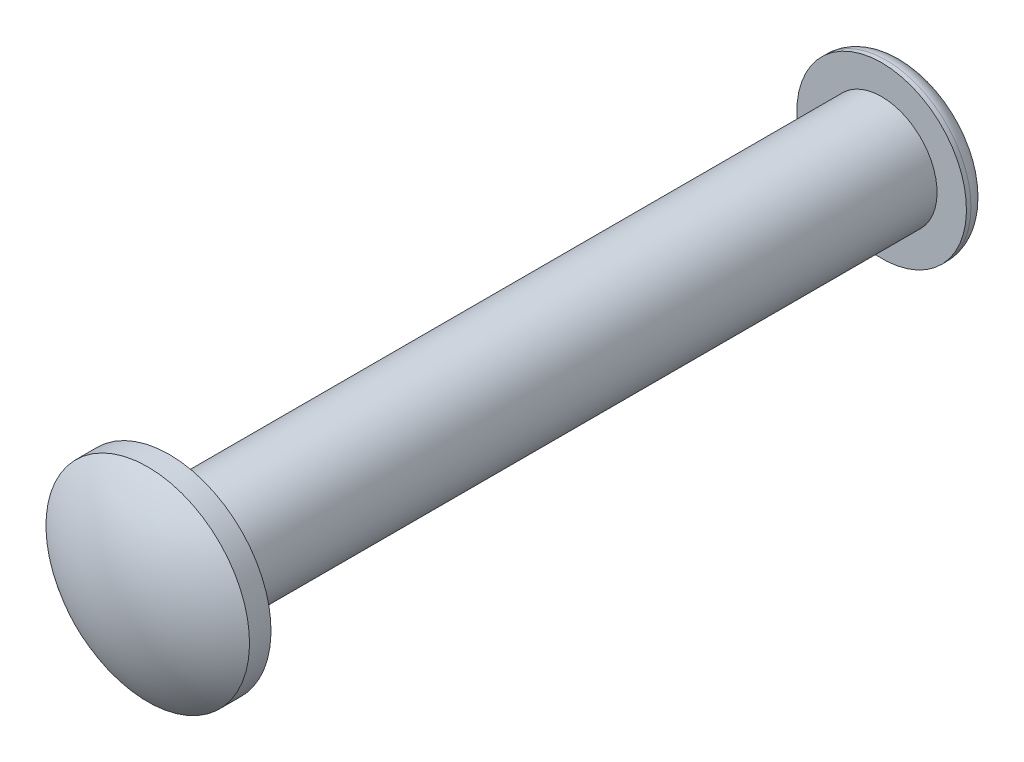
ISO-10303-21;
HEADER;
FILE_DESCRIPTION(('STEP AP214'),'2;1');
FILE_NAME('part.step','',(''),(''),'','','');
FILE_SCHEMA(('AUTOMOTIVE_DESIGN { 1 0 10303 214 1 1 1 1 }'));
ENDSEC;
DATA;
#1=APPLICATION_CONTEXT('core data for automotive mechanical design processes');
#2=APPLICATION_PROTOCOL_DEFINITION('international standard','automotive_design',2000,#1);
#3=PRODUCT_CONTEXT('',#1,'mechanical');
#4=PRODUCT('Part','Part','',(#3));
#5=PRODUCT_RELATED_PRODUCT_CATEGORY('part','',(#4));
#6=PRODUCT_DEFINITION_FORMATION('','',#4);
#7=PRODUCT_DEFINITION_CONTEXT('part definition',#1,'design');
#8=PRODUCT_DEFINITION('design','',#6,#7);
#9=PRODUCT_DEFINITION_SHAPE('','',#8);
#10=(LENGTH_UNIT() NAMED_UNIT(*) SI_UNIT(.MILLI.,.METRE.));
#11=(NAMED_UNIT(*) PLANE_ANGLE_UNIT() SI_UNIT($,.RADIAN.));
#12=(NAMED_UNIT(*) SI_UNIT($,.STERADIAN.) SOLID_ANGLE_UNIT());
#13=UNCERTAINTY_MEASURE_WITH_UNIT(LENGTH_MEASURE(1.E-05),#10,'distance_accuracy_value','');
#14=(GEOMETRIC_REPRESENTATION_CONTEXT(3) GLOBAL_UNCERTAINTY_ASSIGNED_CONTEXT((#13)) GLOBAL_UNIT_ASSIGNED_CONTEXT((#10,
#11,#12)) REPRESENTATION_CONTEXT('',''));
#15=CARTESIAN_POINT('',(0.,0.,0.));
#16=DIRECTION('',(0.,0.,1.));
#17=DIRECTION('',(1.,0.,0.));
#18=AXIS2_PLACEMENT_3D('',#15,#16,#17);
#19=CARTESIAN_POINT('',(-9.44046426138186,2.10713987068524,12.8509497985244));
#20=DIRECTION('',(0.,-2.0465765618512E-08,-1.));
#21=DIRECTION('',(0.,1.,-2.0465765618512E-08));
#22=AXIS2_PLACEMENT_3D('',#19,#20,#21);
#23=CONICAL_SURFACE('',#22,0.68000000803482,1.04719757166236);
#24=CARTESIAN_POINT('',(-9.44046426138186,2.10713987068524,12.8509497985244));
#25=DIRECTION('',(0.,2.0465765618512E-08,1.));
#26=DIRECTION('',(0.,-1.,2.0465765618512E-08));
#27=AXIS2_PLACEMENT_3D('',#24,#25,#26);
#28=CIRCLE('',#27,0.680000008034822);
#29=CARTESIAN_POINT('',(-9.44046426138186,1.42713986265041,12.8509498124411));
#30=VERTEX_POINT('',#29);
#31=EDGE_CURVE('E68',#30,#30,#28,.T.);
#32=ORIENTED_EDGE('',*,*,#31,.F.);
#33=EDGE_LOOP('',(#32));
#34=FACE_BOUND('',#33,.T.);
#35=CARTESIAN_POINT('',(-9.44046426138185,2.10713987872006,13.2435479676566));
#36=VERTEX_POINT('',#35);
#37=VERTEX_LOOP('',#36);
#38=FACE_BOUND('',#37,.T.);
#39=ADVANCED_FACE('F14',(#34,#38),#23,.F.);
#40=CARTESIAN_POINT('',(-9.44046426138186,2.1071398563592,12.1509497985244));
#41=DIRECTION('',(0.,2.04657651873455E-08,1.));
#42=DIRECTION('',(0.,-1.,2.04657651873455E-08));
#43=AXIS2_PLACEMENT_3D('',#40,#41,#42);
#44=CYLINDRICAL_SURFACE('',#43,0.680000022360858);
#45=ORIENTED_EDGE('',*,*,#31,.T.);
#46=EDGE_LOOP('',(#45));
#47=FACE_BOUND('',#46,.T.);
#48=CARTESIAN_POINT('',(-9.44046426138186,2.1071398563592,12.1509498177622));
#49=DIRECTION('',(0.,2.04657651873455E-08,1.));
#50=DIRECTION('',(0.,-1.,2.04657651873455E-08));
#51=AXIS2_PLACEMENT_3D('',#48,#49,#50);
#52=CIRCLE('',#51,0.680000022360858);
#53=CARTESIAN_POINT('',(-9.44046426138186,1.42713983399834,12.1509498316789));
#54=VERTEX_POINT('',#53);
#55=EDGE_CURVE('E18',#54,#54,#52,.T.);
#56=ORIENTED_EDGE('',*,*,#55,.F.);
#57=EDGE_LOOP('',(#56));
#58=FACE_BOUND('',#57,.T.);
#59=ADVANCED_FACE('F27',(#47,#58),#44,.F.);
#60=CARTESIAN_POINT('',(-10.7604642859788,0.787139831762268,12.1509498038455));
#61=DIRECTION('',(0.,0.,-1.));
#62=DIRECTION('',(0.,1.,0.));
#63=AXIS2_PLACEMENT_3D('',#60,#61,#62);
#64=PLANE('',#63);
#65=ORIENTED_EDGE('',*,*,#55,.T.);
#66=EDGE_LOOP('',(#65));
#67=FACE_BOUND('',#66,.T.);
#68=CARTESIAN_POINT('',(-9.44046426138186,2.1071398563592,12.1509498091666));
#69=DIRECTION('',(0.,-2.04657650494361E-08,-1.));
#70=DIRECTION('',(0.,1.,-2.04657650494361E-08));
#71=AXIS2_PLACEMENT_3D('',#68,#69,#70);
#72=CIRCLE('',#71,1.20000002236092);
#73=CARTESIAN_POINT('',(-9.44046426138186,3.30713987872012,12.1509497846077));
#74=VERTEX_POINT('',#73);
#75=EDGE_CURVE('E60',#74,#74,#72,.F.);
#76=ORIENTED_EDGE('',*,*,#75,.F.);
#77=EDGE_LOOP('',(#76));
#78=FACE_BOUND('',#77,.T.);
#79=ADVANCED_FACE('F34',(#67,#78),#64,.T.);
#80=CARTESIAN_POINT('',(-9.44046426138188,2.10713987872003,23.2080465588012));
#81=DIRECTION('',(0.,-2.04657636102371E-08,-1.));
#82=DIRECTION('',(0.,1.,-2.04657636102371E-08));
#83=AXIS2_PLACEMENT_3D('',#80,#81,#82);
#84=SPHERICAL_SURFACE('',#83,2.92290322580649);
#85=CARTESIAN_POINT('',(-9.44046426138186,2.10714012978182,25.510949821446));
#86=DIRECTION('',(0.,-2.04657641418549E-08,-1.));
#87=DIRECTION('',(0.,1.,-2.04657641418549E-08));
#88=AXIS2_PLACEMENT_3D('',#85,#86,#87);
#89=CIRCLE('',#88,1.79999974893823);
#90=CARTESIAN_POINT('',(-9.44046426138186,3.90713987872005,25.5109497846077));
#91=VERTEX_POINT('',#90);
#92=EDGE_CURVE('E62',#91,#91,#89,.T.);
#93=ORIENTED_EDGE('',*,*,#92,.F.);
#94=EDGE_LOOP('',(#93));
#95=FACE_BOUND('',#94,.T.);
#96=ADVANCED_FACE('F82',(#95),#84,.T.);
#97=CARTESIAN_POINT('',(-9.44046426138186,2.10713986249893,12.4509498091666));
#98=DIRECTION('',(0.,-2.04657650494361E-08,-1.));
#99=DIRECTION('',(0.,1.,-2.04657650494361E-08));
#100=AXIS2_PLACEMENT_3D('',#97,#98,#99);
#101=TOROIDAL_SURFACE('',#100,1.20000001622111,0.300000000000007);
#102=ORIENTED_EDGE('',*,*,#75,.T.);
#103=EDGE_LOOP('',(#102));
#104=FACE_BOUND('',#103,.T.);
#105=CARTESIAN_POINT('',(-9.44046426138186,2.10713986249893,12.4509498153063));
#106=DIRECTION('',(0.,2.04657650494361E-08,1.));
#107=DIRECTION('',(0.,-1.,2.04657650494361E-08));
#108=AXIS2_PLACEMENT_3D('',#105,#106,#107);
#109=CIRCLE('',#108,1.50000001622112);
#110=CARTESIAN_POINT('',(-9.44046426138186,0.607139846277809,12.450949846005));
#111=VERTEX_POINT('',#110);
#112=EDGE_CURVE('E59',#111,#111,#109,.T.);
#113=ORIENTED_EDGE('',*,*,#112,.F.);
#114=EDGE_LOOP('',(#113));
#115=FACE_BOUND('',#114,.T.);
#116=ADVANCED_FACE('F79',(#104,#115),#101,.T.);
#117=CARTESIAN_POINT('',(-9.44046426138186,2.10714012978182,25.510949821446));
#118=DIRECTION('',(0.,-2.04657641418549E-08,-1.));
#119=DIRECTION('',(0.,1.,-2.04657641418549E-08));
#120=AXIS2_PLACEMENT_3D('',#117,#118,#119);
#121=CYLINDRICAL_SURFACE('',#120,1.79999974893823);
#122=CARTESIAN_POINT('',(-9.44046426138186,2.10714012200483,25.1309498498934));
#123=DIRECTION('',(0.,-2.04657641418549E-08,-1.));
#124=DIRECTION('',(0.,1.,-2.04657641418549E-08));
#125=AXIS2_PLACEMENT_3D('',#122,#123,#124);
#126=CIRCLE('',#125,1.79999974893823);
#127=CARTESIAN_POINT('',(-9.44046426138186,3.90713987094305,25.1309498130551));
#128=VERTEX_POINT('',#127);
#129=EDGE_CURVE('E54',#128,#128,#126,.T.);
#130=ORIENTED_EDGE('',*,*,#129,.F.);
#131=EDGE_LOOP('',(#130));
#132=FACE_BOUND('',#131,.T.);
#133=ORIENTED_EDGE('',*,*,#92,.T.);
#134=EDGE_LOOP('',(#133));
#135=FACE_BOUND('',#134,.T.);
#136=ADVANCED_FACE('F81',(#132,#135),#121,.T.);
#137=CARTESIAN_POINT('',(-9.44046426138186,2.10713986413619,12.5309498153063));
#138=DIRECTION('',(0.,-2.04657631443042E-08,-1.));
#139=DIRECTION('',(0.,1.,-2.04657631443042E-08));
#140=AXIS2_PLACEMENT_3D('',#137,#138,#139);
#141=CYLINDRICAL_SURFACE('',#140,1.50000001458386);
#142=ORIENTED_EDGE('',*,*,#112,.T.);
#143=EDGE_LOOP('',(#142));
#144=FACE_BOUND('',#143,.T.);
#145=CARTESIAN_POINT('',(-9.44046426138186,2.10713986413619,12.5309498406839));
#146=DIRECTION('',(0.,-2.04657631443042E-08,-1.));
#147=DIRECTION('',(0.,1.,-2.04657631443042E-08));
#148=AXIS2_PLACEMENT_3D('',#145,#146,#147);
#149=CIRCLE('',#148,1.50000001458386);
#150=CARTESIAN_POINT('',(-9.44046426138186,3.60713987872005,12.5309498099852));
#151=VERTEX_POINT('',#150);
#152=EDGE_CURVE('E51',#151,#151,#149,.F.);
#153=ORIENTED_EDGE('',*,*,#152,.F.);
#154=EDGE_LOOP('',(#153));
#155=FACE_BOUND('',#154,.T.);
#156=ADVANCED_FACE('F76',(#144,#155),#141,.T.);
#157=CARTESIAN_POINT('',(-11.4204639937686,0.127140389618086,25.1309498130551));
#158=DIRECTION('',(0.,0.,-1.));
#159=DIRECTION('',(0.,1.,0.));
#160=AXIS2_PLACEMENT_3D('',#157,#158,#159);
#161=PLANE('',#160);
#162=CARTESIAN_POINT('',(-9.44046426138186,2.10714012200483,25.1309498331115));
#163=DIRECTION('',(0.,-2.04657652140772E-08,-1.));
#164=DIRECTION('',(0.,1.,-2.04657652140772E-08));
#165=AXIS2_PLACEMENT_3D('',#162,#163,#164);
#166=CIRCLE('',#165,0.97999975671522);
#167=CARTESIAN_POINT('',(-9.44046426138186,3.08713987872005,25.1309498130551));
#168=VERTEX_POINT('',#167);
#169=EDGE_CURVE('E22',#168,#168,#166,.T.);
#170=ORIENTED_EDGE('',*,*,#169,.F.);
#171=EDGE_LOOP('',(#170));
#172=FACE_BOUND('',#171,.T.);
#173=ORIENTED_EDGE('',*,*,#129,.T.);
#174=EDGE_LOOP('',(#173));
#175=FACE_BOUND('',#174,.T.);
#176=ADVANCED_FACE('F44',(#172,#175),#161,.T.);
#177=CARTESIAN_POINT('',(-7.79046424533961,0.45713984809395,12.5309498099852));
#178=DIRECTION('',(0.,0.,1.));
#179=DIRECTION('',(0.,1.,0.));
#180=AXIS2_PLACEMENT_3D('',#177,#178,#179);
#181=PLANE('',#180);
#182=CARTESIAN_POINT('',(-9.44046426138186,2.10713986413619,12.5309498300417));
#183=DIRECTION('',(0.,-2.04657652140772E-08,-1.));
#184=DIRECTION('',(0.,1.,-2.04657652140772E-08));
#185=AXIS2_PLACEMENT_3D('',#182,#183,#184);
#186=CIRCLE('',#185,0.97999975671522);
#187=CARTESIAN_POINT('',(-9.44046426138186,3.08713962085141,12.5309498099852));
#188=VERTEX_POINT('',#187);
#189=EDGE_CURVE('E9',#188,#188,#186,.F.);
#190=ORIENTED_EDGE('',*,*,#189,.F.);
#191=EDGE_LOOP('',(#190));
#192=FACE_BOUND('',#191,.T.);
#193=ORIENTED_EDGE('',*,*,#152,.T.);
#194=EDGE_LOOP('',(#193));
#195=FACE_BOUND('',#194,.T.);
#196=ADVANCED_FACE('F39',(#192,#195),#181,.T.);
#197=CARTESIAN_POINT('',(-9.44046426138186,2.10714012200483,25.1309498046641));
#198=DIRECTION('',(0.,-2.04657652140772E-08,-1.));
#199=DIRECTION('',(0.,1.,-2.04657652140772E-08));
#200=AXIS2_PLACEMENT_3D('',#197,#198,#199);
#201=CYLINDRICAL_SURFACE('',#200,0.97999975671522);
#202=ORIENTED_EDGE('',*,*,#189,.T.);
#203=EDGE_LOOP('',(#202));
#204=FACE_BOUND('',#203,.T.);
#205=ORIENTED_EDGE('',*,*,#169,.T.);
#206=EDGE_LOOP('',(#205));
#207=FACE_BOUND('',#206,.T.);
#208=ADVANCED_FACE('F16',(#204,#207),#201,.T.);
#209=CLOSED_SHELL('',(#39,#59,#79,#96,#116,#136,#156,#176,#196,#208));
#210=MANIFOLD_SOLID_BREP('B1',#209);
#211=ADVANCED_BREP_SHAPE_REPRESENTATION('',(#18,#210),#14);
#212=SHAPE_DEFINITION_REPRESENTATION(#9,#211);
ENDSEC;
END-ISO-10303-21;
